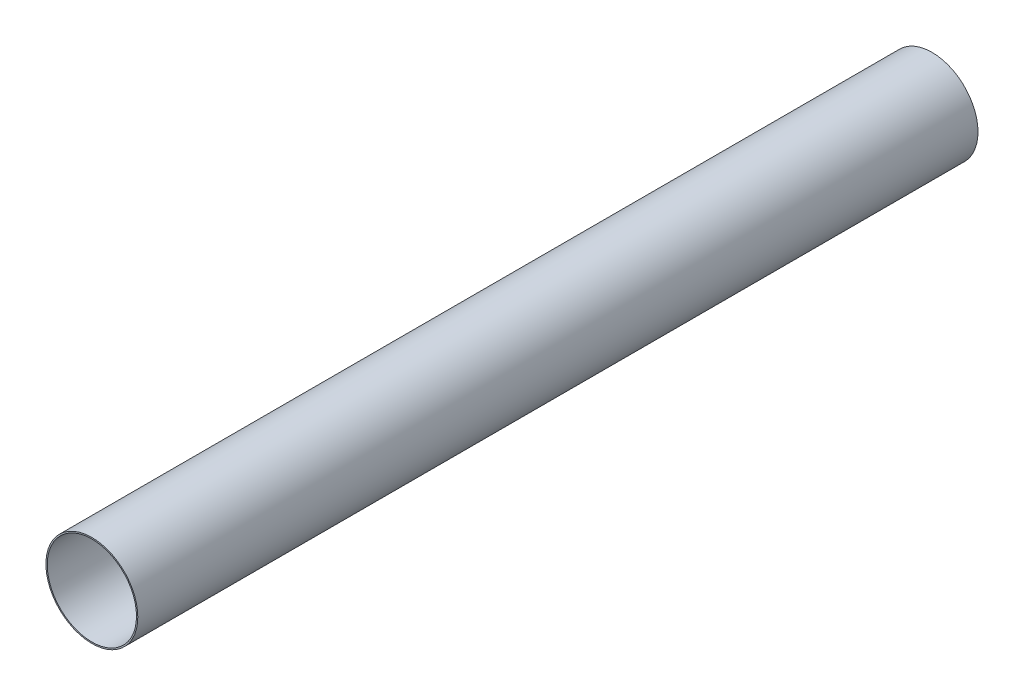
from build123d import *

# Parameters (mm, degrees)
SKETCH1_R      = 27.78125
SKETCH1_R_2    = 26.9875
EXTRUDE1_DEPTH = 508


with BuildPart() as part:
    # Sketch1 → Extrude1 (new body)
    with BuildSketch(Plane.XY):
        Circle(SKETCH1_R)
        Circle(SKETCH1_R_2, mode=Mode.SUBTRACT)
    extrude(amount=EXTRUDE1_DEPTH)


solid = part.part
